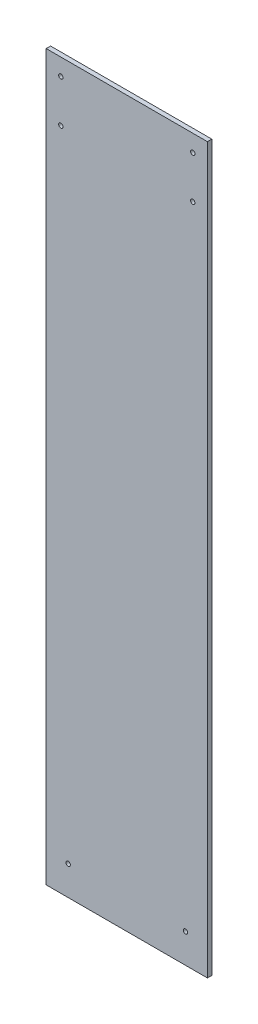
ISO-10303-21;
HEADER;
FILE_DESCRIPTION(('STEP AP214'),'2;1');
FILE_NAME('part.step','',(''),(''),'','','');
FILE_SCHEMA(('AUTOMOTIVE_DESIGN { 1 0 10303 214 1 1 1 1 }'));
ENDSEC;
DATA;
#1=APPLICATION_CONTEXT('core data for automotive mechanical design processes');
#2=APPLICATION_PROTOCOL_DEFINITION('international standard','automotive_design',2000,#1);
#3=PRODUCT_CONTEXT('',#1,'mechanical');
#4=PRODUCT('Part','Part','',(#3));
#5=PRODUCT_RELATED_PRODUCT_CATEGORY('part','',(#4));
#6=PRODUCT_DEFINITION_FORMATION('','',#4);
#7=PRODUCT_DEFINITION_CONTEXT('part definition',#1,'design');
#8=PRODUCT_DEFINITION('design','',#6,#7);
#9=PRODUCT_DEFINITION_SHAPE('','',#8);
#10=(LENGTH_UNIT() NAMED_UNIT(*) SI_UNIT(.MILLI.,.METRE.));
#11=(NAMED_UNIT(*) PLANE_ANGLE_UNIT() SI_UNIT($,.RADIAN.));
#12=(NAMED_UNIT(*) SI_UNIT($,.STERADIAN.) SOLID_ANGLE_UNIT());
#13=UNCERTAINTY_MEASURE_WITH_UNIT(LENGTH_MEASURE(1.E-05),#10,'distance_accuracy_value','');
#14=(GEOMETRIC_REPRESENTATION_CONTEXT(3) GLOBAL_UNCERTAINTY_ASSIGNED_CONTEXT((#13)) GLOBAL_UNIT_ASSIGNED_CONTEXT((#10,
#11,#12)) REPRESENTATION_CONTEXT('',''));
#15=CARTESIAN_POINT('',(0.,0.,0.));
#16=DIRECTION('',(0.,0.,1.));
#17=DIRECTION('',(1.,0.,0.));
#18=AXIS2_PLACEMENT_3D('',#15,#16,#17);
#19=CARTESIAN_POINT('',(0.,0.,3.));
#20=DIRECTION('',(0.,0.,1.));
#21=DIRECTION('',(1.,0.,0.));
#22=AXIS2_PLACEMENT_3D('',#19,#20,#21);
#23=PLANE('',#22);
#24=CARTESIAN_POINT('',(-44.9999999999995,199.5,3.));
#25=DIRECTION('',(0.,0.,1.));
#26=DIRECTION('',(1.,0.,0.));
#27=AXIS2_PLACEMENT_3D('',#24,#25,#26);
#28=CIRCLE('',#27,1.5);
#29=CARTESIAN_POINT('',(-43.4999999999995,199.5,3.));
#30=VERTEX_POINT('',#29);
#31=EDGE_CURVE('E133',#30,#30,#28,.T.);
#32=ORIENTED_EDGE('',*,*,#31,.F.);
#33=EDGE_LOOP('',(#32));
#34=FACE_BOUND('',#33,.T.);
#35=CARTESIAN_POINT('',(44.9999999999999,228.5,3.));
#36=DIRECTION('',(0.,0.,1.));
#37=DIRECTION('',(1.,0.,0.));
#38=AXIS2_PLACEMENT_3D('',#35,#36,#37);
#39=CIRCLE('',#38,1.5);
#40=CARTESIAN_POINT('',(46.4999999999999,228.5,3.));
#41=VERTEX_POINT('',#40);
#42=EDGE_CURVE('E121',#41,#41,#39,.T.);
#43=ORIENTED_EDGE('',*,*,#42,.F.);
#44=EDGE_LOOP('',(#43));
#45=FACE_BOUND('',#44,.T.);
#46=CARTESIAN_POINT('',(40.,-234.,3.));
#47=DIRECTION('',(0.,0.,1.));
#48=DIRECTION('',(1.,0.,0.));
#49=AXIS2_PLACEMENT_3D('',#46,#47,#48);
#50=CIRCLE('',#49,1.5);
#51=CARTESIAN_POINT('',(41.5,-234.,3.));
#52=VERTEX_POINT('',#51);
#53=EDGE_CURVE('E100',#52,#52,#50,.T.);
#54=ORIENTED_EDGE('',*,*,#53,.F.);
#55=EDGE_LOOP('',(#54));
#56=FACE_BOUND('',#55,.T.);
#57=DIRECTION('',(0.,-1.,0.));
#58=VECTOR('',#57,1.);
#59=CARTESIAN_POINT('',(-55.,240.,3.));
#60=LINE('',#59,#58);
#61=CARTESIAN_POINT('',(-55.,240.,3.));
#62=VERTEX_POINT('',#61);
#63=CARTESIAN_POINT('',(-54.9999999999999,-254.,3.));
#64=VERTEX_POINT('',#63);
#65=EDGE_CURVE('E85',#62,#64,#60,.T.);
#66=ORIENTED_EDGE('',*,*,#65,.T.);
#67=DIRECTION('',(1.,0.,0.));
#68=VECTOR('',#67,1.);
#69=CARTESIAN_POINT('',(-54.9999999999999,-254.,3.));
#70=LINE('',#69,#68);
#71=CARTESIAN_POINT('',(55.,-254.,3.));
#72=VERTEX_POINT('',#71);
#73=EDGE_CURVE('E80',#64,#72,#70,.T.);
#74=ORIENTED_EDGE('',*,*,#73,.T.);
#75=DIRECTION('',(0.,1.,0.));
#76=VECTOR('',#75,1.);
#77=CARTESIAN_POINT('',(55.,240.,3.));
#78=LINE('',#77,#76);
#79=CARTESIAN_POINT('',(55.,240.,3.));
#80=VERTEX_POINT('',#79);
#81=EDGE_CURVE('E83',#72,#80,#78,.T.);
#82=ORIENTED_EDGE('',*,*,#81,.T.);
#83=DIRECTION('',(-1.,0.,0.));
#84=VECTOR('',#83,1.);
#85=CARTESIAN_POINT('',(-55.,240.,3.));
#86=LINE('',#85,#84);
#87=EDGE_CURVE('E50',#80,#62,#86,.T.);
#88=ORIENTED_EDGE('',*,*,#87,.T.);
#89=EDGE_LOOP('',(#66,#74,#82,#88));
#90=FACE_BOUND('',#89,.T.);
#91=CARTESIAN_POINT('',(-40.,-234.,3.));
#92=DIRECTION('',(0.,0.,1.));
#93=DIRECTION('',(1.,0.,0.));
#94=AXIS2_PLACEMENT_3D('',#91,#92,#93);
#95=CIRCLE('',#94,1.5);
#96=CARTESIAN_POINT('',(-38.5,-234.,3.));
#97=VERTEX_POINT('',#96);
#98=EDGE_CURVE('E115',#97,#97,#95,.T.);
#99=ORIENTED_EDGE('',*,*,#98,.F.);
#100=EDGE_LOOP('',(#99));
#101=FACE_BOUND('',#100,.T.);
#102=CARTESIAN_POINT('',(44.9999999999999,199.5,3.));
#103=DIRECTION('',(0.,0.,1.));
#104=DIRECTION('',(1.,0.,0.));
#105=AXIS2_PLACEMENT_3D('',#102,#103,#104);
#106=CIRCLE('',#105,1.5);
#107=CARTESIAN_POINT('',(46.4999999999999,199.5,3.));
#108=VERTEX_POINT('',#107);
#109=EDGE_CURVE('E127',#108,#108,#106,.T.);
#110=ORIENTED_EDGE('',*,*,#109,.F.);
#111=EDGE_LOOP('',(#110));
#112=FACE_BOUND('',#111,.T.);
#113=CARTESIAN_POINT('',(-44.9999999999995,228.5,3.));
#114=DIRECTION('',(0.,0.,1.));
#115=DIRECTION('',(1.,0.,0.));
#116=AXIS2_PLACEMENT_3D('',#113,#114,#115);
#117=CIRCLE('',#116,1.5);
#118=CARTESIAN_POINT('',(-43.4999999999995,228.5,3.));
#119=VERTEX_POINT('',#118);
#120=EDGE_CURVE('E139',#119,#119,#117,.T.);
#121=ORIENTED_EDGE('',*,*,#120,.F.);
#122=EDGE_LOOP('',(#121));
#123=FACE_BOUND('',#122,.T.);
#124=ADVANCED_FACE('F33',(#34,#45,#56,#90,#101,#112,#123),#23,.T.);
#125=CARTESIAN_POINT('',(0.,0.,0.));
#126=DIRECTION('',(0.,0.,1.));
#127=DIRECTION('',(1.,0.,0.));
#128=AXIS2_PLACEMENT_3D('',#125,#126,#127);
#129=PLANE('',#128);
#130=DIRECTION('',(0.,-1.,0.));
#131=VECTOR('',#130,1.);
#132=CARTESIAN_POINT('',(-55.,240.,0.));
#133=LINE('',#132,#131);
#134=CARTESIAN_POINT('',(-55.,240.,0.));
#135=VERTEX_POINT('',#134);
#136=CARTESIAN_POINT('',(-54.9999999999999,-254.,0.));
#137=VERTEX_POINT('',#136);
#138=EDGE_CURVE('E97',#135,#137,#133,.T.);
#139=ORIENTED_EDGE('',*,*,#138,.F.);
#140=DIRECTION('',(-1.,0.,0.));
#141=VECTOR('',#140,1.);
#142=CARTESIAN_POINT('',(-55.,240.,0.));
#143=LINE('',#142,#141);
#144=CARTESIAN_POINT('',(55.,240.,0.));
#145=VERTEX_POINT('',#144);
#146=EDGE_CURVE('E73',#145,#135,#143,.T.);
#147=ORIENTED_EDGE('',*,*,#146,.F.);
#148=DIRECTION('',(0.,1.,0.));
#149=VECTOR('',#148,1.);
#150=CARTESIAN_POINT('',(55.,240.,0.));
#151=LINE('',#150,#149);
#152=CARTESIAN_POINT('',(55.,-254.,0.));
#153=VERTEX_POINT('',#152);
#154=EDGE_CURVE('E67',#153,#145,#151,.T.);
#155=ORIENTED_EDGE('',*,*,#154,.F.);
#156=DIRECTION('',(1.,0.,0.));
#157=VECTOR('',#156,1.);
#158=CARTESIAN_POINT('',(-54.9999999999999,-254.,0.));
#159=LINE('',#158,#157);
#160=EDGE_CURVE('E89',#137,#153,#159,.T.);
#161=ORIENTED_EDGE('',*,*,#160,.F.);
#162=EDGE_LOOP('',(#139,#147,#155,#161));
#163=FACE_BOUND('',#162,.T.);
#164=CARTESIAN_POINT('',(40.,-234.,0.));
#165=DIRECTION('',(0.,0.,1.));
#166=DIRECTION('',(1.,0.,0.));
#167=AXIS2_PLACEMENT_3D('',#164,#165,#166);
#168=CIRCLE('',#167,1.5);
#169=CARTESIAN_POINT('',(41.5,-234.,0.));
#170=VERTEX_POINT('',#169);
#171=EDGE_CURVE('E112',#170,#170,#168,.T.);
#172=ORIENTED_EDGE('',*,*,#171,.T.);
#173=EDGE_LOOP('',(#172));
#174=FACE_BOUND('',#173,.T.);
#175=CARTESIAN_POINT('',(-40.,-234.,0.));
#176=DIRECTION('',(0.,0.,1.));
#177=DIRECTION('',(1.,0.,0.));
#178=AXIS2_PLACEMENT_3D('',#175,#176,#177);
#179=CIRCLE('',#178,1.5);
#180=CARTESIAN_POINT('',(-38.5,-234.,0.));
#181=VERTEX_POINT('',#180);
#182=EDGE_CURVE('E118',#181,#181,#179,.T.);
#183=ORIENTED_EDGE('',*,*,#182,.T.);
#184=EDGE_LOOP('',(#183));
#185=FACE_BOUND('',#184,.T.);
#186=CARTESIAN_POINT('',(44.9999999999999,228.5,0.));
#187=DIRECTION('',(0.,0.,1.));
#188=DIRECTION('',(1.,0.,0.));
#189=AXIS2_PLACEMENT_3D('',#186,#187,#188);
#190=CIRCLE('',#189,1.5);
#191=CARTESIAN_POINT('',(46.4999999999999,228.5,0.));
#192=VERTEX_POINT('',#191);
#193=EDGE_CURVE('E124',#192,#192,#190,.T.);
#194=ORIENTED_EDGE('',*,*,#193,.T.);
#195=EDGE_LOOP('',(#194));
#196=FACE_BOUND('',#195,.T.);
#197=CARTESIAN_POINT('',(44.9999999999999,199.5,0.));
#198=DIRECTION('',(0.,0.,1.));
#199=DIRECTION('',(1.,0.,0.));
#200=AXIS2_PLACEMENT_3D('',#197,#198,#199);
#201=CIRCLE('',#200,1.5);
#202=CARTESIAN_POINT('',(46.4999999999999,199.5,0.));
#203=VERTEX_POINT('',#202);
#204=EDGE_CURVE('E130',#203,#203,#201,.T.);
#205=ORIENTED_EDGE('',*,*,#204,.T.);
#206=EDGE_LOOP('',(#205));
#207=FACE_BOUND('',#206,.T.);
#208=CARTESIAN_POINT('',(-44.9999999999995,199.5,0.));
#209=DIRECTION('',(0.,0.,1.));
#210=DIRECTION('',(1.,0.,0.));
#211=AXIS2_PLACEMENT_3D('',#208,#209,#210);
#212=CIRCLE('',#211,1.5);
#213=CARTESIAN_POINT('',(-43.4999999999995,199.5,0.));
#214=VERTEX_POINT('',#213);
#215=EDGE_CURVE('E136',#214,#214,#212,.T.);
#216=ORIENTED_EDGE('',*,*,#215,.T.);
#217=EDGE_LOOP('',(#216));
#218=FACE_BOUND('',#217,.T.);
#219=CARTESIAN_POINT('',(-44.9999999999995,228.5,0.));
#220=DIRECTION('',(0.,0.,1.));
#221=DIRECTION('',(1.,0.,0.));
#222=AXIS2_PLACEMENT_3D('',#219,#220,#221);
#223=CIRCLE('',#222,1.5);
#224=CARTESIAN_POINT('',(-43.4999999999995,228.5,0.));
#225=VERTEX_POINT('',#224);
#226=EDGE_CURVE('E142',#225,#225,#223,.T.);
#227=ORIENTED_EDGE('',*,*,#226,.T.);
#228=EDGE_LOOP('',(#227));
#229=FACE_BOUND('',#228,.T.);
#230=ADVANCED_FACE('F108',(#163,#174,#185,#196,#207,#218,#229),#129,.F.);
#231=CARTESIAN_POINT('',(-55.,240.,3.));
#232=DIRECTION('',(1.,0.,0.));
#233=DIRECTION('',(0.,1.,0.));
#234=AXIS2_PLACEMENT_3D('',#231,#232,#233);
#235=PLANE('',#234);
#236=ORIENTED_EDGE('',*,*,#138,.T.);
#237=DIRECTION('',(0.,0.,-1.));
#238=VECTOR('',#237,1.);
#239=CARTESIAN_POINT('',(-54.9999999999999,-254.,3.));
#240=LINE('',#239,#238);
#241=EDGE_CURVE('E11',#64,#137,#240,.T.);
#242=ORIENTED_EDGE('',*,*,#241,.F.);
#243=ORIENTED_EDGE('',*,*,#65,.F.);
#244=DIRECTION('',(0.,0.,-1.));
#245=VECTOR('',#244,1.);
#246=CARTESIAN_POINT('',(-55.,240.,3.));
#247=LINE('',#246,#245);
#248=EDGE_CURVE('E93',#62,#135,#247,.T.);
#249=ORIENTED_EDGE('',*,*,#248,.T.);
#250=EDGE_LOOP('',(#236,#242,#243,#249));
#251=FACE_BOUND('',#250,.T.);
#252=ADVANCED_FACE('F35',(#251),#235,.F.);
#253=CARTESIAN_POINT('',(-54.9999999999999,-254.,3.));
#254=DIRECTION('',(0.,1.,0.));
#255=DIRECTION('',(0.,0.,1.));
#256=AXIS2_PLACEMENT_3D('',#253,#254,#255);
#257=PLANE('',#256);
#258=ORIENTED_EDGE('',*,*,#160,.T.);
#259=DIRECTION('',(0.,0.,-1.));
#260=VECTOR('',#259,1.);
#261=CARTESIAN_POINT('',(55.,-254.,3.));
#262=LINE('',#261,#260);
#263=EDGE_CURVE('E42',#72,#153,#262,.T.);
#264=ORIENTED_EDGE('',*,*,#263,.F.);
#265=ORIENTED_EDGE('',*,*,#73,.F.);
#266=ORIENTED_EDGE('',*,*,#241,.T.);
#267=EDGE_LOOP('',(#258,#264,#265,#266));
#268=FACE_BOUND('',#267,.T.);
#269=ADVANCED_FACE('F88',(#268),#257,.F.);
#270=CARTESIAN_POINT('',(55.,240.,3.));
#271=DIRECTION('',(-1.,0.,0.));
#272=DIRECTION('',(0.,-1.,0.));
#273=AXIS2_PLACEMENT_3D('',#270,#271,#272);
#274=PLANE('',#273);
#275=ORIENTED_EDGE('',*,*,#154,.T.);
#276=DIRECTION('',(0.,0.,-1.));
#277=VECTOR('',#276,1.);
#278=CARTESIAN_POINT('',(55.,240.,3.));
#279=LINE('',#278,#277);
#280=EDGE_CURVE('E90',#80,#145,#279,.T.);
#281=ORIENTED_EDGE('',*,*,#280,.F.);
#282=ORIENTED_EDGE('',*,*,#81,.F.);
#283=ORIENTED_EDGE('',*,*,#263,.T.);
#284=EDGE_LOOP('',(#275,#281,#282,#283));
#285=FACE_BOUND('',#284,.T.);
#286=ADVANCED_FACE('F91',(#285),#274,.F.);
#287=CARTESIAN_POINT('',(-55.,240.,3.));
#288=DIRECTION('',(0.,-1.,0.));
#289=DIRECTION('',(0.,0.,-1.));
#290=AXIS2_PLACEMENT_3D('',#287,#288,#289);
#291=PLANE('',#290);
#292=ORIENTED_EDGE('',*,*,#146,.T.);
#293=ORIENTED_EDGE('',*,*,#248,.F.);
#294=ORIENTED_EDGE('',*,*,#87,.F.);
#295=ORIENTED_EDGE('',*,*,#280,.T.);
#296=EDGE_LOOP('',(#292,#293,#294,#295));
#297=FACE_BOUND('',#296,.T.);
#298=ADVANCED_FACE('F105',(#297),#291,.F.);
#299=CARTESIAN_POINT('',(40.,-234.,3.));
#300=DIRECTION('',(0.,0.,-1.));
#301=DIRECTION('',(-1.,0.,0.));
#302=AXIS2_PLACEMENT_3D('',#299,#300,#301);
#303=CYLINDRICAL_SURFACE('',#302,1.5);
#304=ORIENTED_EDGE('',*,*,#53,.T.);
#305=EDGE_LOOP('',(#304));
#306=FACE_BOUND('',#305,.T.);
#307=ORIENTED_EDGE('',*,*,#171,.F.);
#308=EDGE_LOOP('',(#307));
#309=FACE_BOUND('',#308,.T.);
#310=ADVANCED_FACE('F161',(#306,#309),#303,.F.);
#311=CARTESIAN_POINT('',(-40.,-234.,3.));
#312=DIRECTION('',(0.,0.,-1.));
#313=DIRECTION('',(-1.,0.,0.));
#314=AXIS2_PLACEMENT_3D('',#311,#312,#313);
#315=CYLINDRICAL_SURFACE('',#314,1.5);
#316=ORIENTED_EDGE('',*,*,#98,.T.);
#317=EDGE_LOOP('',(#316));
#318=FACE_BOUND('',#317,.T.);
#319=ORIENTED_EDGE('',*,*,#182,.F.);
#320=EDGE_LOOP('',(#319));
#321=FACE_BOUND('',#320,.T.);
#322=ADVANCED_FACE('F207',(#318,#321),#315,.F.);
#323=CARTESIAN_POINT('',(44.9999999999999,228.5,3.));
#324=DIRECTION('',(0.,0.,-1.));
#325=DIRECTION('',(-1.,0.,0.));
#326=AXIS2_PLACEMENT_3D('',#323,#324,#325);
#327=CYLINDRICAL_SURFACE('',#326,1.5);
#328=ORIENTED_EDGE('',*,*,#42,.T.);
#329=EDGE_LOOP('',(#328));
#330=FACE_BOUND('',#329,.T.);
#331=ORIENTED_EDGE('',*,*,#193,.F.);
#332=EDGE_LOOP('',(#331));
#333=FACE_BOUND('',#332,.T.);
#334=ADVANCED_FACE('F215',(#330,#333),#327,.F.);
#335=CARTESIAN_POINT('',(44.9999999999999,199.5,3.));
#336=DIRECTION('',(0.,0.,-1.));
#337=DIRECTION('',(-1.,0.,0.));
#338=AXIS2_PLACEMENT_3D('',#335,#336,#337);
#339=CYLINDRICAL_SURFACE('',#338,1.5);
#340=ORIENTED_EDGE('',*,*,#109,.T.);
#341=EDGE_LOOP('',(#340));
#342=FACE_BOUND('',#341,.T.);
#343=ORIENTED_EDGE('',*,*,#204,.F.);
#344=EDGE_LOOP('',(#343));
#345=FACE_BOUND('',#344,.T.);
#346=ADVANCED_FACE('F223',(#342,#345),#339,.F.);
#347=CARTESIAN_POINT('',(-44.9999999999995,199.5,3.));
#348=DIRECTION('',(0.,0.,-1.));
#349=DIRECTION('',(-1.,0.,0.));
#350=AXIS2_PLACEMENT_3D('',#347,#348,#349);
#351=CYLINDRICAL_SURFACE('',#350,1.5);
#352=ORIENTED_EDGE('',*,*,#31,.T.);
#353=EDGE_LOOP('',(#352));
#354=FACE_BOUND('',#353,.T.);
#355=ORIENTED_EDGE('',*,*,#215,.F.);
#356=EDGE_LOOP('',(#355));
#357=FACE_BOUND('',#356,.T.);
#358=ADVANCED_FACE('F232',(#354,#357),#351,.F.);
#359=CARTESIAN_POINT('',(-44.9999999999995,228.5,3.));
#360=DIRECTION('',(0.,0.,-1.));
#361=DIRECTION('',(-1.,0.,0.));
#362=AXIS2_PLACEMENT_3D('',#359,#360,#361);
#363=CYLINDRICAL_SURFACE('',#362,1.5);
#364=ORIENTED_EDGE('',*,*,#120,.T.);
#365=EDGE_LOOP('',(#364));
#366=FACE_BOUND('',#365,.T.);
#367=ORIENTED_EDGE('',*,*,#226,.F.);
#368=EDGE_LOOP('',(#367));
#369=FACE_BOUND('',#368,.T.);
#370=ADVANCED_FACE('F148',(#366,#369),#363,.F.);
#371=CLOSED_SHELL('',(#124,#230,#252,#269,#286,#298,#310,#322,#334,#346,#358,#370));
#372=MANIFOLD_SOLID_BREP('B2',#371);
#373=ADVANCED_BREP_SHAPE_REPRESENTATION('',(#18,#372),#14);
#374=SHAPE_DEFINITION_REPRESENTATION(#9,#373);
ENDSEC;
END-ISO-10303-21;
